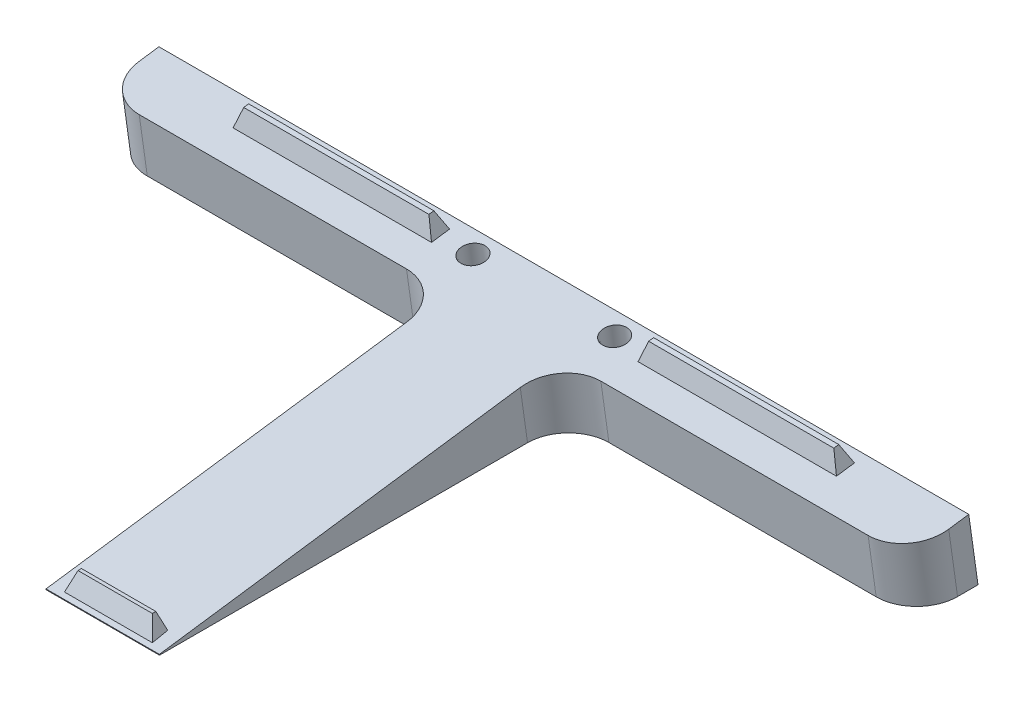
ISO-10303-21;
HEADER;
FILE_DESCRIPTION(('STEP AP214'),'2;1');
FILE_NAME('part.step','',(''),(''),'','','');
FILE_SCHEMA(('AUTOMOTIVE_DESIGN { 1 0 10303 214 1 1 1 1 }'));
ENDSEC;
DATA;
#1=APPLICATION_CONTEXT('core data for automotive mechanical design processes');
#2=APPLICATION_PROTOCOL_DEFINITION('international standard','automotive_design',2000,#1);
#3=PRODUCT_CONTEXT('',#1,'mechanical');
#4=PRODUCT('Part','Part','',(#3));
#5=PRODUCT_RELATED_PRODUCT_CATEGORY('part','',(#4));
#6=PRODUCT_DEFINITION_FORMATION('','',#4);
#7=PRODUCT_DEFINITION_CONTEXT('part definition',#1,'design');
#8=PRODUCT_DEFINITION('design','',#6,#7);
#9=PRODUCT_DEFINITION_SHAPE('','',#8);
#10=(LENGTH_UNIT() NAMED_UNIT(*) SI_UNIT(.MILLI.,.METRE.));
#11=(NAMED_UNIT(*) PLANE_ANGLE_UNIT() SI_UNIT($,.RADIAN.));
#12=(NAMED_UNIT(*) SI_UNIT($,.STERADIAN.) SOLID_ANGLE_UNIT());
#13=UNCERTAINTY_MEASURE_WITH_UNIT(LENGTH_MEASURE(1.E-05),#10,'distance_accuracy_value','');
#14=(GEOMETRIC_REPRESENTATION_CONTEXT(3) GLOBAL_UNCERTAINTY_ASSIGNED_CONTEXT((#13)) GLOBAL_UNIT_ASSIGNED_CONTEXT((#10,
#11,#12)) REPRESENTATION_CONTEXT('',''));
#15=CARTESIAN_POINT('',(0.,0.,0.));
#16=DIRECTION('',(0.,0.,1.));
#17=DIRECTION('',(1.,0.,0.));
#18=AXIS2_PLACEMENT_3D('',#15,#16,#17);
#19=CARTESIAN_POINT('',(0.,-0.173024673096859,-0.024317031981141));
#20=DIRECTION('',(0.,-0.99026806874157,-0.139173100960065));
#21=DIRECTION('',(0.,0.139173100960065,-0.99026806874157));
#22=AXIS2_PLACEMENT_3D('',#19,#20,#21);
#23=PLANE('',#22);
#24=CARTESIAN_POINT('',(17.5,15.5178007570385,-111.670341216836));
#25=DIRECTION('',(0.,0.99026806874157,0.139173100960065));
#26=DIRECTION('',(0.,0.139173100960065,-0.99026806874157));
#27=AXIS2_PLACEMENT_3D('',#24,#25,#26);
#28=CIRCLE('',#27,3.);
#29=CARTESIAN_POINT('',(17.5,15.9353200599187,-114.641145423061));
#30=VERTEX_POINT('',#29);
#31=EDGE_CURVE('E246',#30,#30,#28,.T.);
#32=ORIENTED_EDGE('',*,*,#31,.F.);
#33=EDGE_LOOP('',(#32));
#34=FACE_BOUND('',#33,.T.);
#35=DIRECTION('',(0.,0.139173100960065,-0.99026806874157));
#36=VECTOR('',#35,1.);
#37=CARTESIAN_POINT('',(74.5,15.2046612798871,-109.442238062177));
#38=LINE('',#37,#36);
#39=CARTESIAN_POINT('',(74.5,15.2046612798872,-109.442238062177));
#40=VERTEX_POINT('',#39);
#41=CARTESIAN_POINT('',(74.5,15.8309402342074,-113.898444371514));
#42=VERTEX_POINT('',#41);
#43=EDGE_CURVE('E240',#40,#42,#38,.T.);
#44=ORIENTED_EDGE('',*,*,#43,.F.);
#45=DIRECTION('',(-1.,0.,0.));
#46=VECTOR('',#45,1.);
#47=CARTESIAN_POINT('',(74.5,15.2046612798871,-109.442238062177));
#48=LINE('',#47,#46);
#49=CARTESIAN_POINT('',(25.5,15.2046612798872,-109.442238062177));
#50=VERTEX_POINT('',#49);
#51=EDGE_CURVE('E237',#40,#50,#48,.T.);
#52=ORIENTED_EDGE('',*,*,#51,.T.);
#53=DIRECTION('',(0.,0.139173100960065,-0.99026806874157));
#54=VECTOR('',#53,1.);
#55=CARTESIAN_POINT('',(25.5,15.2046612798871,-109.442238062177));
#56=LINE('',#55,#54);
#57=CARTESIAN_POINT('',(25.5,15.8309402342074,-113.898444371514));
#58=VERTEX_POINT('',#57);
#59=EDGE_CURVE('E234',#50,#58,#56,.T.);
#60=ORIENTED_EDGE('',*,*,#59,.T.);
#61=DIRECTION('',(-1.,0.,0.));
#62=VECTOR('',#61,1.);
#63=CARTESIAN_POINT('',(74.5,15.8309402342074,-113.898444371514));
#64=LINE('',#63,#62);
#65=EDGE_CURVE('E231',#42,#58,#64,.T.);
#66=ORIENTED_EDGE('',*,*,#65,.F.);
#67=EDGE_LOOP('',(#44,#52,#60,#66));
#68=FACE_BOUND('',#67,.T.);
#69=DIRECTION('',(0.,0.139173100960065,-0.99026806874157));
#70=VECTOR('',#69,1.);
#71=CARTESIAN_POINT('',(-100.,14.1260697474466,-101.767660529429));
#72=LINE('',#71,#70);
#73=CARTESIAN_POINT('',(-100.,15.5178007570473,-111.670341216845));
#74=VERTEX_POINT('',#73);
#75=CARTESIAN_POINT('',(-100.,16.2136662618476,-116.621681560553));
#76=VERTEX_POINT('',#75);
#77=EDGE_CURVE('E370',#74,#76,#72,.T.);
#78=ORIENTED_EDGE('',*,*,#77,.F.);
#79=CARTESIAN_POINT('',(-90.,15.5178007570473,-111.670341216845));
#80=DIRECTION('',(0.,-0.99026806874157,-0.139173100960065));
#81=DIRECTION('',(0.,0.139173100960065,-0.99026806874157));
#82=AXIS2_PLACEMENT_3D('',#79,#80,#81);
#83=CIRCLE('',#82,10.);
#84=CARTESIAN_POINT('',(-90.,14.1260697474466,-101.767660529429));
#85=VERTEX_POINT('',#84);
#86=EDGE_CURVE('E383',#74,#85,#83,.F.);
#87=ORIENTED_EDGE('',*,*,#86,.T.);
#88=DIRECTION('',(-1.,0.,0.));
#89=VECTOR('',#88,1.);
#90=CARTESIAN_POINT('',(-14.,14.1260697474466,-101.767660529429));
#91=LINE('',#90,#89);
#92=CARTESIAN_POINT('',(-24.,14.1260697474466,-101.767660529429));
#93=VERTEX_POINT('',#92);
#94=EDGE_CURVE('E367',#93,#85,#91,.T.);
#95=ORIENTED_EDGE('',*,*,#94,.F.);
#96=CARTESIAN_POINT('',(-24.,12.734338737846,-91.8649798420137));
#97=DIRECTION('',(0.,-0.99026806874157,-0.139173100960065));
#98=DIRECTION('',(0.,0.139173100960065,-0.99026806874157));
#99=AXIS2_PLACEMENT_3D('',#96,#97,#98);
#100=CIRCLE('',#99,10.);
#101=CARTESIAN_POINT('',(-14.,12.734338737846,-91.8649798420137));
#102=VERTEX_POINT('',#101);
#103=EDGE_CURVE('E43',#93,#102,#100,.T.);
#104=ORIENTED_EDGE('',*,*,#103,.T.);
#105=DIRECTION('',(0.,0.139173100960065,-0.99026806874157));
#106=VECTOR('',#105,1.);
#107=CARTESIAN_POINT('',(-14.,14.1260697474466,-101.767660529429));
#108=LINE('',#107,#106);
#109=CARTESIAN_POINT('',(-14.,0.208759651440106,-2.74085365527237));
#110=VERTEX_POINT('',#109);
#111=EDGE_CURVE('E364',#110,#102,#108,.T.);
#112=ORIENTED_EDGE('',*,*,#111,.F.);
#113=DIRECTION('',(-1.,0.,0.));
#114=VECTOR('',#113,1.);
#115=CARTESIAN_POINT('',(0.,0.208759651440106,-2.74085365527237));
#116=LINE('',#115,#114);
#117=CARTESIAN_POINT('',(14.,0.208759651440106,-2.74085365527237));
#118=VERTEX_POINT('',#117);
#119=EDGE_CURVE('E349',#118,#110,#116,.T.);
#120=ORIENTED_EDGE('',*,*,#119,.F.);
#121=DIRECTION('',(0.,0.139173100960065,-0.99026806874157));
#122=VECTOR('',#121,1.);
#123=CARTESIAN_POINT('',(14.,14.1260697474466,-101.767660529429));
#124=LINE('',#123,#122);
#125=CARTESIAN_POINT('',(14.,12.734338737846,-91.8649798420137));
#126=VERTEX_POINT('',#125);
#127=EDGE_CURVE('E267',#118,#126,#124,.T.);
#128=ORIENTED_EDGE('',*,*,#127,.T.);
#129=CARTESIAN_POINT('',(24.,12.734338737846,-91.8649798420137));
#130=DIRECTION('',(0.,0.99026806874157,0.139173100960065));
#131=DIRECTION('',(0.,0.139173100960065,-0.99026806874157));
#132=AXIS2_PLACEMENT_3D('',#129,#130,#131);
#133=CIRCLE('',#132,10.);
#134=CARTESIAN_POINT('',(24.,14.1260697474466,-101.767660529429));
#135=VERTEX_POINT('',#134);
#136=EDGE_CURVE('E306',#135,#126,#133,.T.);
#137=ORIENTED_EDGE('',*,*,#136,.F.);
#138=DIRECTION('',(1.,0.,0.));
#139=VECTOR('',#138,1.);
#140=CARTESIAN_POINT('',(14.,14.1260697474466,-101.767660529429));
#141=LINE('',#140,#139);
#142=CARTESIAN_POINT('',(90.,14.1260697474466,-101.767660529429));
#143=VERTEX_POINT('',#142);
#144=EDGE_CURVE('E281',#135,#143,#141,.T.);
#145=ORIENTED_EDGE('',*,*,#144,.T.);
#146=CARTESIAN_POINT('',(90.,15.5178007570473,-111.670341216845));
#147=DIRECTION('',(0.,0.99026806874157,0.139173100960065));
#148=DIRECTION('',(0.,0.139173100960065,-0.99026806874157));
#149=AXIS2_PLACEMENT_3D('',#146,#147,#148);
#150=CIRCLE('',#149,10.);
#151=CARTESIAN_POINT('',(100.,15.5178007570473,-111.670341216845));
#152=VERTEX_POINT('',#151);
#153=EDGE_CURVE('E293',#152,#143,#150,.F.);
#154=ORIENTED_EDGE('',*,*,#153,.F.);
#155=DIRECTION('',(0.,0.139173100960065,-0.99026806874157));
#156=VECTOR('',#155,1.);
#157=CARTESIAN_POINT('',(100.,14.1260697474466,-101.767660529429));
#158=LINE('',#157,#156);
#159=CARTESIAN_POINT('',(100.,16.2136662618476,-116.621681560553));
#160=VERTEX_POINT('',#159);
#161=EDGE_CURVE('E284',#152,#160,#158,.T.);
#162=ORIENTED_EDGE('',*,*,#161,.T.);
#163=DIRECTION('',(1.,0.,0.));
#164=VECTOR('',#163,1.);
#165=CARTESIAN_POINT('',(0.,16.2136662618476,-116.621681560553));
#166=LINE('',#165,#164);
#167=EDGE_CURVE('E372',#76,#160,#166,.T.);
#168=ORIENTED_EDGE('',*,*,#167,.F.);
#169=EDGE_LOOP('',(#78,#87,#95,#104,#112,#120,#128,#137,#145,#154,#162,#168));
#170=FACE_BOUND('',#169,.T.);
#171=CARTESIAN_POINT('',(-17.5,15.5178007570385,-111.670341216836));
#172=DIRECTION('',(0.,-0.99026806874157,-0.139173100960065));
#173=DIRECTION('',(0.,0.139173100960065,-0.99026806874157));
#174=AXIS2_PLACEMENT_3D('',#171,#172,#173);
#175=CIRCLE('',#174,3.);
#176=CARTESIAN_POINT('',(-17.5,15.9353200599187,-114.641145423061));
#177=VERTEX_POINT('',#176);
#178=EDGE_CURVE('E325',#177,#177,#175,.T.);
#179=ORIENTED_EDGE('',*,*,#178,.T.);
#180=EDGE_LOOP('',(#179));
#181=FACE_BOUND('',#180,.T.);
#182=DIRECTION('',(0.,0.139173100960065,-0.99026806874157));
#183=VECTOR('',#182,1.);
#184=CARTESIAN_POINT('',(-74.5,15.2046612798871,-109.442238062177));
#185=LINE('',#184,#183);
#186=CARTESIAN_POINT('',(-74.5,15.2046612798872,-109.442238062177));
#187=VERTEX_POINT('',#186);
#188=CARTESIAN_POINT('',(-74.5,15.8309402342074,-113.898444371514));
#189=VERTEX_POINT('',#188);
#190=EDGE_CURVE('E319',#187,#189,#185,.T.);
#191=ORIENTED_EDGE('',*,*,#190,.T.);
#192=DIRECTION('',(1.,0.,0.));
#193=VECTOR('',#192,1.);
#194=CARTESIAN_POINT('',(-74.5,15.8309402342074,-113.898444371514));
#195=LINE('',#194,#193);
#196=CARTESIAN_POINT('',(-25.5,15.8309402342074,-113.898444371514));
#197=VERTEX_POINT('',#196);
#198=EDGE_CURVE('E311',#189,#197,#195,.T.);
#199=ORIENTED_EDGE('',*,*,#198,.T.);
#200=DIRECTION('',(0.,0.139173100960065,-0.99026806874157));
#201=VECTOR('',#200,1.);
#202=CARTESIAN_POINT('',(-25.5,15.2046612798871,-109.442238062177));
#203=LINE('',#202,#201);
#204=CARTESIAN_POINT('',(-25.5,15.2046612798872,-109.442238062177));
#205=VERTEX_POINT('',#204);
#206=EDGE_CURVE('E313',#205,#197,#203,.T.);
#207=ORIENTED_EDGE('',*,*,#206,.F.);
#208=DIRECTION('',(1.,0.,0.));
#209=VECTOR('',#208,1.);
#210=CARTESIAN_POINT('',(-74.5,15.2046612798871,-109.442238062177));
#211=LINE('',#210,#209);
#212=EDGE_CURVE('E316',#187,#205,#211,.T.);
#213=ORIENTED_EDGE('',*,*,#212,.F.);
#214=EDGE_LOOP('',(#191,#199,#207,#213));
#215=FACE_BOUND('',#214,.T.);
#216=DIRECTION('',(0.0505900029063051,0.138994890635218,-0.989000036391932));
#217=VECTOR('',#216,1.);
#218=CARTESIAN_POINT('',(-11.0346618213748,-0.0952325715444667,-0.577836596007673));
#219=LINE('',#218,#217);
#220=CARTESIAN_POINT('',(-10.6471902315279,0.96933687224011,-8.15264178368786));
#221=VERTEX_POINT('',#220);
#222=CARTESIAN_POINT('',(-10.8517465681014,0.407322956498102,-4.15370498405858));
#223=VERTEX_POINT('',#222);
#224=EDGE_CURVE('E214',#221,#223,#219,.F.);
#225=ORIENTED_EDGE('',*,*,#224,.F.);
#226=DIRECTION('',(1.,0.,0.));
#227=VECTOR('',#226,1.);
#228=CARTESIAN_POINT('',(0.,0.969336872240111,-8.15264178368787));
#229=LINE('',#228,#227);
#230=CARTESIAN_POINT('',(10.6471902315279,0.969336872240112,-8.15264178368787));
#231=VERTEX_POINT('',#230);
#232=EDGE_CURVE('E215',#231,#221,#229,.F.);
#233=ORIENTED_EDGE('',*,*,#232,.F.);
#234=DIRECTION('',(0.0505900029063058,-0.138994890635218,0.989000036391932));
#235=VECTOR('',#234,1.);
#236=CARTESIAN_POINT('',(11.0346618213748,-0.0952325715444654,-0.577836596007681));
#237=LINE('',#236,#235);
#238=CARTESIAN_POINT('',(10.8517465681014,0.407322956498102,-4.15370498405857));
#239=VERTEX_POINT('',#238);
#240=EDGE_CURVE('E55',#239,#231,#237,.F.);
#241=ORIENTED_EDGE('',*,*,#240,.F.);
#242=DIRECTION('',(-1.,0.,0.));
#243=VECTOR('',#242,1.);
#244=CARTESIAN_POINT('',(0.,0.407322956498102,-4.15370498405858));
#245=LINE('',#244,#243);
#246=EDGE_CURVE('E50',#223,#239,#245,.F.);
#247=ORIENTED_EDGE('',*,*,#246,.F.);
#248=EDGE_LOOP('',(#225,#233,#241,#247));
#249=FACE_BOUND('',#248,.T.);
#250=ADVANCED_FACE('F35',(#34,#68,#170,#181,#215,#249),#23,.F.);
#251=CARTESIAN_POINT('',(0.,-143.65349220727,-139.089545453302));
#252=DIRECTION('',(0.,-0.139173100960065,0.99026806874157));
#253=DIRECTION('',(0.,-0.99026806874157,-0.139173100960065));
#254=AXIS2_PLACEMENT_3D('',#251,#252,#253);
#255=PLANE('',#254);
#256=ORIENTED_EDGE('',*,*,#167,.T.);
#257=DIRECTION('',(0.,0.99026806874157,0.139173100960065));
#258=VECTOR('',#257,1.);
#259=CARTESIAN_POINT('',(100.,-143.65349220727,-139.089545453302));
#260=LINE('',#259,#258);
#261=CARTESIAN_POINT('',(100.,0.,-118.900363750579));
#262=VERTEX_POINT('',#261);
#263=EDGE_CURVE('E287',#262,#160,#260,.T.);
#264=ORIENTED_EDGE('',*,*,#263,.F.);
#265=DIRECTION('',(-1.,0.,0.));
#266=VECTOR('',#265,1.);
#267=CARTESIAN_POINT('',(0.,0.,-118.900363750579));
#268=LINE('',#267,#266);
#269=CARTESIAN_POINT('',(-100.,0.,-118.900363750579));
#270=VERTEX_POINT('',#269);
#271=EDGE_CURVE('E354',#262,#270,#268,.T.);
#272=ORIENTED_EDGE('',*,*,#271,.T.);
#273=DIRECTION('',(0.,0.99026806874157,0.139173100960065));
#274=VECTOR('',#273,1.);
#275=CARTESIAN_POINT('',(-100.,-143.65349220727,-139.089545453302));
#276=LINE('',#275,#274);
#277=EDGE_CURVE('E374',#270,#76,#276,.T.);
#278=ORIENTED_EDGE('',*,*,#277,.T.);
#279=EDGE_LOOP('',(#256,#264,#272,#278));
#280=FACE_BOUND('',#279,.T.);
#281=ADVANCED_FACE('F424',(#280),#255,.F.);
#282=CARTESIAN_POINT('',(-100.,-145.741088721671,-124.235524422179));
#283=DIRECTION('',(1.,0.,0.));
#284=DIRECTION('',(0.,0.,-1.));
#285=AXIS2_PLACEMENT_3D('',#282,#283,#284);
#286=PLANE('',#285);
#287=DIRECTION('',(0.,0.,1.));
#288=VECTOR('',#287,1.);
#289=CARTESIAN_POINT('',(-100.,0.,-124.235524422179));
#290=LINE('',#289,#288);
#291=CARTESIAN_POINT('',(-100.,0.,-113.851225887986));
#292=VERTEX_POINT('',#291);
#293=EDGE_CURVE('E350',#270,#292,#290,.T.);
#294=ORIENTED_EDGE('',*,*,#293,.T.);
#295=DIRECTION('',(0.,0.99026806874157,0.139173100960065));
#296=VECTOR('',#295,1.);
#297=CARTESIAN_POINT('',(-100.,-144.34935771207,-134.138205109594));
#298=LINE('',#297,#296);
#299=EDGE_CURVE('E361',#292,#74,#298,.T.);
#300=ORIENTED_EDGE('',*,*,#299,.T.);
#301=ORIENTED_EDGE('',*,*,#77,.T.);
#302=ORIENTED_EDGE('',*,*,#277,.F.);
#303=EDGE_LOOP('',(#294,#300,#301,#302));
#304=FACE_BOUND('',#303,.T.);
#305=ADVANCED_FACE('F420',(#304),#286,.F.);
#306=CARTESIAN_POINT('',(-14.,-145.741088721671,-124.235524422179));
#307=DIRECTION('',(0.,0.139173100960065,-0.99026806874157));
#308=DIRECTION('',(0.,0.99026806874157,0.139173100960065));
#309=AXIS2_PLACEMENT_3D('',#306,#307,#308);
#310=PLANE('',#309);
#311=ORIENTED_EDGE('',*,*,#94,.T.);
#312=DIRECTION('',(0.,0.99026806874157,0.139173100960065));
#313=VECTOR('',#312,1.);
#314=CARTESIAN_POINT('',(-90.,-145.741088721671,-124.235524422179));
#315=LINE('',#314,#313);
#316=CARTESIAN_POINT('',(-90.,0.,-103.7529501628));
#317=VERTEX_POINT('',#316);
#318=EDGE_CURVE('E388',#85,#317,#315,.F.);
#319=ORIENTED_EDGE('',*,*,#318,.T.);
#320=DIRECTION('',(1.,0.,0.));
#321=VECTOR('',#320,1.);
#322=CARTESIAN_POINT('',(-14.,0.,-103.7529501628));
#323=LINE('',#322,#321);
#324=CARTESIAN_POINT('',(-24.,0.,-103.7529501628));
#325=VERTEX_POINT('',#324);
#326=EDGE_CURVE('E353',#317,#325,#323,.T.);
#327=ORIENTED_EDGE('',*,*,#326,.T.);
#328=DIRECTION('',(0.,0.99026806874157,0.139173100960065));
#329=VECTOR('',#328,1.);
#330=CARTESIAN_POINT('',(-24.,14.1260697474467,-101.767660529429));
#331=LINE('',#330,#329);
#332=EDGE_CURVE('E385',#325,#93,#331,.T.);
#333=ORIENTED_EDGE('',*,*,#332,.T.);
#334=EDGE_LOOP('',(#311,#319,#327,#333));
#335=FACE_BOUND('',#334,.T.);
#336=ADVANCED_FACE('F413',(#335),#310,.F.);
#337=CARTESIAN_POINT('',(-14.,-145.741088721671,-124.235524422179));
#338=DIRECTION('',(1.,0.,0.));
#339=DIRECTION('',(0.,0.,-1.));
#340=AXIS2_PLACEMENT_3D('',#337,#338,#339);
#341=PLANE('',#340);
#342=ORIENTED_EDGE('',*,*,#111,.T.);
#343=DIRECTION('',(0.,0.99026806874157,0.139173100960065));
#344=VECTOR('',#343,1.);
#345=CARTESIAN_POINT('',(-14.,-1.39173100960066,-93.8502694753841));
#346=LINE('',#345,#344);
#347=CARTESIAN_POINT('',(-14.,0.,-93.6546744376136));
#348=VERTEX_POINT('',#347);
#349=EDGE_CURVE('E392',#102,#348,#346,.F.);
#350=ORIENTED_EDGE('',*,*,#349,.T.);
#351=DIRECTION('',(0.,0.,1.));
#352=VECTOR('',#351,1.);
#353=CARTESIAN_POINT('',(-14.,0.,-124.235524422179));
#354=LINE('',#353,#352);
#355=CARTESIAN_POINT('',(-14.,0.,-2.77019291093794));
#356=VERTEX_POINT('',#355);
#357=EDGE_CURVE('E357',#348,#356,#354,.T.);
#358=ORIENTED_EDGE('',*,*,#357,.T.);
#359=DIRECTION('',(0.,0.99026806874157,0.139173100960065));
#360=VECTOR('',#359,1.);
#361=CARTESIAN_POINT('',(-14.,-159.658398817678,-25.2087175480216));
#362=LINE('',#361,#360);
#363=EDGE_CURVE('E377',#356,#110,#362,.T.);
#364=ORIENTED_EDGE('',*,*,#363,.T.);
#365=EDGE_LOOP('',(#342,#350,#358,#364));
#366=FACE_BOUND('',#365,.T.);
#367=ADVANCED_FACE('F402',(#366),#341,.F.);
#368=CARTESIAN_POINT('',(0.,-159.658398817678,-25.2087175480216));
#369=DIRECTION('',(0.,0.139173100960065,-0.99026806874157));
#370=DIRECTION('',(0.,0.99026806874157,0.139173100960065));
#371=AXIS2_PLACEMENT_3D('',#368,#369,#370);
#372=PLANE('',#371);
#373=ORIENTED_EDGE('',*,*,#363,.F.);
#374=DIRECTION('',(1.,0.,0.));
#375=VECTOR('',#374,1.);
#376=CARTESIAN_POINT('',(0.,0.,-2.77019291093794));
#377=LINE('',#376,#375);
#378=CARTESIAN_POINT('',(14.,0.,-2.77019291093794));
#379=VERTEX_POINT('',#378);
#380=EDGE_CURVE('E359',#356,#379,#377,.T.);
#381=ORIENTED_EDGE('',*,*,#380,.T.);
#382=DIRECTION('',(0.,0.99026806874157,0.139173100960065));
#383=VECTOR('',#382,1.);
#384=CARTESIAN_POINT('',(14.,-159.658398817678,-25.2087175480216));
#385=LINE('',#384,#383);
#386=EDGE_CURVE('E272',#379,#118,#385,.T.);
#387=ORIENTED_EDGE('',*,*,#386,.T.);
#388=ORIENTED_EDGE('',*,*,#119,.T.);
#389=EDGE_LOOP('',(#373,#381,#387,#388));
#390=FACE_BOUND('',#389,.T.);
#391=ADVANCED_FACE('F447',(#390),#372,.F.);
#392=CARTESIAN_POINT('',(0.,0.,0.));
#393=DIRECTION('',(0.,1.,0.));
#394=DIRECTION('',(0.,0.,1.));
#395=AXIS2_PLACEMENT_3D('',#392,#393,#394);
#396=PLANE('',#395);
#397=CARTESIAN_POINT('',(17.5,0.,-113.868806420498));
#398=DIRECTION('',(0.,-1.,0.));
#399=DIRECTION('',(0.,0.,-1.));
#400=AXIS2_PLACEMENT_3D('',#397,#398,#399);
#401=ELLIPSE('',#400,3.58216587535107,3.54726176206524);
#402=CARTESIAN_POINT('',(17.5,0.,-117.450972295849));
#403=VERTEX_POINT('',#402);
#404=EDGE_CURVE('E264',#403,#403,#401,.T.);
#405=ORIENTED_EDGE('',*,*,#404,.F.);
#406=EDGE_LOOP('',(#405));
#407=FACE_BOUND('',#406,.T.);
#408=ORIENTED_EDGE('',*,*,#326,.F.);
#409=CARTESIAN_POINT('',(-90.,0.,-113.851225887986));
#410=DIRECTION('',(0.,1.,0.));
#411=DIRECTION('',(0.,0.,1.));
#412=AXIS2_PLACEMENT_3D('',#409,#410,#411);
#413=ELLIPSE('',#412,10.0982757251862,10.);
#414=EDGE_CURVE('E390',#317,#292,#413,.F.);
#415=ORIENTED_EDGE('',*,*,#414,.T.);
#416=ORIENTED_EDGE('',*,*,#293,.F.);
#417=ORIENTED_EDGE('',*,*,#271,.F.);
#418=DIRECTION('',(0.,0.,1.));
#419=VECTOR('',#418,1.);
#420=CARTESIAN_POINT('',(100.,0.,-124.235524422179));
#421=LINE('',#420,#419);
#422=CARTESIAN_POINT('',(100.,0.,-113.851225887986));
#423=VERTEX_POINT('',#422);
#424=EDGE_CURVE('E268',#262,#423,#421,.T.);
#425=ORIENTED_EDGE('',*,*,#424,.T.);
#426=CARTESIAN_POINT('',(90.,0.,-113.851225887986));
#427=DIRECTION('',(0.,-1.,0.));
#428=DIRECTION('',(0.,0.,1.));
#429=AXIS2_PLACEMENT_3D('',#426,#427,#428);
#430=ELLIPSE('',#429,10.0982757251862,10.);
#431=CARTESIAN_POINT('',(90.,0.,-103.7529501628));
#432=VERTEX_POINT('',#431);
#433=EDGE_CURVE('E301',#432,#423,#430,.F.);
#434=ORIENTED_EDGE('',*,*,#433,.F.);
#435=DIRECTION('',(-1.,0.,0.));
#436=VECTOR('',#435,1.);
#437=CARTESIAN_POINT('',(14.,0.,-103.7529501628));
#438=LINE('',#437,#436);
#439=CARTESIAN_POINT('',(24.,0.,-103.7529501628));
#440=VERTEX_POINT('',#439);
#441=EDGE_CURVE('E271',#432,#440,#438,.T.);
#442=ORIENTED_EDGE('',*,*,#441,.T.);
#443=CARTESIAN_POINT('',(24.,0.,-93.6546744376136));
#444=DIRECTION('',(0.,-1.,0.));
#445=DIRECTION('',(0.,0.,-1.));
#446=AXIS2_PLACEMENT_3D('',#443,#444,#445);
#447=ELLIPSE('',#446,10.0982757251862,10.);
#448=CARTESIAN_POINT('',(14.,0.,-93.6546744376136));
#449=VERTEX_POINT('',#448);
#450=EDGE_CURVE('E309',#449,#440,#447,.T.);
#451=ORIENTED_EDGE('',*,*,#450,.F.);
#452=DIRECTION('',(0.,0.,1.));
#453=VECTOR('',#452,1.);
#454=CARTESIAN_POINT('',(14.,0.,-124.235524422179));
#455=LINE('',#454,#453);
#456=EDGE_CURVE('E275',#449,#379,#455,.T.);
#457=ORIENTED_EDGE('',*,*,#456,.T.);
#458=ORIENTED_EDGE('',*,*,#380,.F.);
#459=ORIENTED_EDGE('',*,*,#357,.F.);
#460=CARTESIAN_POINT('',(-24.,0.,-93.6546744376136));
#461=DIRECTION('',(0.,1.,0.));
#462=DIRECTION('',(0.,0.,-1.));
#463=AXIS2_PLACEMENT_3D('',#460,#461,#462);
#464=ELLIPSE('',#463,10.0982757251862,10.);
#465=EDGE_CURVE('E12',#348,#325,#464,.T.);
#466=ORIENTED_EDGE('',*,*,#465,.T.);
#467=EDGE_LOOP('',(#408,#415,#416,#417,#425,#434,#442,#451,#457,#458,#459,#466));
#468=FACE_BOUND('',#467,.T.);
#469=CARTESIAN_POINT('',(-17.5,0.,-113.868806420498));
#470=DIRECTION('',(0.,1.,0.));
#471=DIRECTION('',(0.,0.,-1.));
#472=AXIS2_PLACEMENT_3D('',#469,#470,#471);
#473=ELLIPSE('',#472,3.58216587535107,3.54726176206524);
#474=CARTESIAN_POINT('',(-17.5,0.,-117.450972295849));
#475=VERTEX_POINT('',#474);
#476=EDGE_CURVE('E346',#475,#475,#473,.T.);
#477=ORIENTED_EDGE('',*,*,#476,.T.);
#478=EDGE_LOOP('',(#477));
#479=FACE_BOUND('',#478,.T.);
#480=ADVANCED_FACE('F408',(#407,#468,#479),#396,.F.);
#481=CARTESIAN_POINT('',(-17.5,15.5178007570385,-111.670341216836));
#482=DIRECTION('',(0.,-0.99026806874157,-0.139173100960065));
#483=DIRECTION('',(0.,0.139173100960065,-0.99026806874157));
#484=AXIS2_PLACEMENT_3D('',#481,#482,#483);
#485=CONICAL_SURFACE('',#484,3.,0.0349065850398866);
#486=ORIENTED_EDGE('',*,*,#476,.F.);
#487=EDGE_LOOP('',(#486));
#488=FACE_BOUND('',#487,.T.);
#489=ORIENTED_EDGE('',*,*,#178,.F.);
#490=EDGE_LOOP('',(#489));
#491=FACE_BOUND('',#490,.T.);
#492=ADVANCED_FACE('F454',(#488,#491),#485,.F.);
#493=CARTESIAN_POINT('',(-90.,-144.34935771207,-134.138205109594));
#494=DIRECTION('',(0.,0.99026806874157,0.139173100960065));
#495=DIRECTION('',(0.,-0.139173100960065,0.99026806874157));
#496=AXIS2_PLACEMENT_3D('',#493,#494,#495);
#497=CYLINDRICAL_SURFACE('',#496,10.);
#498=ORIENTED_EDGE('',*,*,#414,.F.);
#499=ORIENTED_EDGE('',*,*,#318,.F.);
#500=ORIENTED_EDGE('',*,*,#86,.F.);
#501=ORIENTED_EDGE('',*,*,#299,.F.);
#502=EDGE_LOOP('',(#498,#499,#500,#501));
#503=FACE_BOUND('',#502,.T.);
#504=ADVANCED_FACE('F416',(#503),#497,.T.);
#505=CARTESIAN_POINT('',(-24.,-147.132819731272,-114.332843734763));
#506=DIRECTION('',(0.,-0.99026806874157,-0.139173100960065));
#507=DIRECTION('',(0.,0.139173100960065,-0.99026806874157));
#508=AXIS2_PLACEMENT_3D('',#505,#506,#507);
#509=CYLINDRICAL_SURFACE('',#508,10.);
#510=ORIENTED_EDGE('',*,*,#465,.F.);
#511=ORIENTED_EDGE('',*,*,#349,.F.);
#512=ORIENTED_EDGE('',*,*,#103,.F.);
#513=ORIENTED_EDGE('',*,*,#332,.F.);
#514=EDGE_LOOP('',(#510,#511,#512,#513));
#515=FACE_BOUND('',#514,.T.);
#516=ADVANCED_FACE('F37',(#515),#509,.F.);
#517=CARTESIAN_POINT('',(-74.5,15.8309402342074,-113.898444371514));
#518=DIRECTION('',(0.,0.469471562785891,-0.882947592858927));
#519=DIRECTION('',(0.,0.882947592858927,0.469471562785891));
#520=AXIS2_PLACEMENT_3D('',#517,#518,#519);
#521=PLANE('',#520);
#522=ORIENTED_EDGE('',*,*,#198,.F.);
#523=DIRECTION('',(-0.323615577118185,-0.835434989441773,-0.444208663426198));
#524=VECTOR('',#523,1.);
#525=CARTESIAN_POINT('',(-74.0287283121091,17.0475592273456,-113.251556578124));
#526=LINE('',#525,#524);
#527=CARTESIAN_POINT('',(-72.8621339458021,20.0591996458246,-111.650238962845));
#528=VERTEX_POINT('',#527);
#529=EDGE_CURVE('E322',#528,#189,#526,.T.);
#530=ORIENTED_EDGE('',*,*,#529,.F.);
#531=DIRECTION('',(1.,0.,0.));
#532=VECTOR('',#531,1.);
#533=CARTESIAN_POINT('',(-74.5,20.0591996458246,-111.650238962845));
#534=LINE('',#533,#532);
#535=CARTESIAN_POINT('',(-27.1378660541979,20.0591996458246,-111.650238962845));
#536=VERTEX_POINT('',#535);
#537=EDGE_CURVE('E321',#528,#536,#534,.T.);
#538=ORIENTED_EDGE('',*,*,#537,.T.);
#539=DIRECTION('',(-0.323615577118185,0.835434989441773,0.444208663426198));
#540=VECTOR('',#539,1.);
#541=CARTESIAN_POINT('',(-25.9712716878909,17.0475592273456,-113.251556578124));
#542=LINE('',#541,#540);
#543=EDGE_CURVE('E327',#536,#197,#542,.F.);
#544=ORIENTED_EDGE('',*,*,#543,.T.);
#545=EDGE_LOOP('',(#522,#530,#538,#544));
#546=FACE_BOUND('',#545,.T.);
#547=ADVANCED_FACE('F514',(#546),#521,.T.);
#548=CARTESIAN_POINT('',(-74.5,15.2046612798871,-109.442238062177));
#549=DIRECTION('',(-0.939692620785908,0.338691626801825,0.0476000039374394));
#550=DIRECTION('',(-0.33907597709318,-0.940758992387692,0.));
#551=AXIS2_PLACEMENT_3D('',#548,#549,#550);
#552=PLANE('',#551);
#553=ORIENTED_EDGE('',*,*,#190,.F.);
#554=DIRECTION('',(0.323615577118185,0.92551215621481,-0.196723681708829));
#555=VECTOR('',#554,1.);
#556=CARTESIAN_POINT('',(-74.5,15.2046612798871,-109.442238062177));
#557=LINE('',#556,#555);
#558=CARTESIAN_POINT('',(-72.8621339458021,19.8888144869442,-110.437885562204));
#559=VERTEX_POINT('',#558);
#560=EDGE_CURVE('E326',#559,#187,#557,.F.);
#561=ORIENTED_EDGE('',*,*,#560,.F.);
#562=DIRECTION('',(0.,0.139173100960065,-0.99026806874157));
#563=VECTOR('',#562,1.);
#564=CARTESIAN_POINT('',(-72.8621339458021,19.6608675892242,-108.815959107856));
#565=LINE('',#564,#563);
#566=EDGE_CURVE('E331',#559,#528,#565,.T.);
#567=ORIENTED_EDGE('',*,*,#566,.T.);
#568=ORIENTED_EDGE('',*,*,#529,.T.);
#569=EDGE_LOOP('',(#553,#561,#567,#568));
#570=FACE_BOUND('',#569,.T.);
#571=ADVANCED_FACE('F521',(#570),#552,.T.);
#572=CARTESIAN_POINT('',(-74.5,15.2046612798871,-109.442238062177));
#573=DIRECTION('',(0.,0.20791169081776,0.978147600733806));
#574=DIRECTION('',(0.,-0.978147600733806,0.20791169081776));
#575=AXIS2_PLACEMENT_3D('',#572,#573,#574);
#576=PLANE('',#575);
#577=ORIENTED_EDGE('',*,*,#212,.T.);
#578=DIRECTION('',(0.323615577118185,-0.92551215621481,0.196723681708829));
#579=VECTOR('',#578,1.);
#580=CARTESIAN_POINT('',(-25.5,15.2046612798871,-109.442238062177));
#581=LINE('',#580,#579);
#582=CARTESIAN_POINT('',(-27.1378660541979,19.8888144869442,-110.437885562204));
#583=VERTEX_POINT('',#582);
#584=EDGE_CURVE('E330',#583,#205,#581,.T.);
#585=ORIENTED_EDGE('',*,*,#584,.F.);
#586=DIRECTION('',(-1.,0.,0.));
#587=VECTOR('',#586,1.);
#588=CARTESIAN_POINT('',(-74.5,19.8888144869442,-110.437885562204));
#589=LINE('',#588,#587);
#590=EDGE_CURVE('E341',#559,#583,#589,.F.);
#591=ORIENTED_EDGE('',*,*,#590,.F.);
#592=ORIENTED_EDGE('',*,*,#560,.T.);
#593=EDGE_LOOP('',(#577,#585,#591,#592));
#594=FACE_BOUND('',#593,.T.);
#595=ADVANCED_FACE('F530',(#594),#576,.T.);
#596=CARTESIAN_POINT('',(-25.5,15.2046612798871,-109.442238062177));
#597=DIRECTION('',(0.939692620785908,0.338691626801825,0.0476000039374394));
#598=DIRECTION('',(-0.33907597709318,0.940758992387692,0.));
#599=AXIS2_PLACEMENT_3D('',#596,#597,#598);
#600=PLANE('',#599);
#601=ORIENTED_EDGE('',*,*,#206,.T.);
#602=ORIENTED_EDGE('',*,*,#543,.F.);
#603=DIRECTION('',(0.,-0.139173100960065,0.99026806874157));
#604=VECTOR('',#603,1.);
#605=CARTESIAN_POINT('',(-27.1378660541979,19.6608675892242,-108.815959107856));
#606=LINE('',#605,#604);
#607=EDGE_CURVE('E338',#583,#536,#606,.F.);
#608=ORIENTED_EDGE('',*,*,#607,.F.);
#609=ORIENTED_EDGE('',*,*,#584,.T.);
#610=EDGE_LOOP('',(#601,#602,#608,#609));
#611=FACE_BOUND('',#610,.T.);
#612=ADVANCED_FACE('F539',(#611),#600,.T.);
#613=CARTESIAN_POINT('',(0.,4.28318163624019,0.60196192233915));
#614=DIRECTION('',(0.,0.99026806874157,0.139173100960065));
#615=DIRECTION('',(0.,-0.139173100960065,0.99026806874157));
#616=AXIS2_PLACEMENT_3D('',#613,#614,#615);
#617=PLANE('',#616);
#618=ORIENTED_EDGE('',*,*,#537,.F.);
#619=ORIENTED_EDGE('',*,*,#566,.F.);
#620=ORIENTED_EDGE('',*,*,#590,.T.);
#621=ORIENTED_EDGE('',*,*,#607,.T.);
#622=EDGE_LOOP('',(#618,#619,#620,#621));
#623=FACE_BOUND('',#622,.T.);
#624=ADVANCED_FACE('F548',(#623),#617,.T.);
#625=CARTESIAN_POINT('',(100.,-145.741088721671,-124.235524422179));
#626=DIRECTION('',(-1.,0.,0.));
#627=DIRECTION('',(0.,0.,-1.));
#628=AXIS2_PLACEMENT_3D('',#625,#626,#627);
#629=PLANE('',#628);
#630=ORIENTED_EDGE('',*,*,#424,.F.);
#631=ORIENTED_EDGE('',*,*,#263,.T.);
#632=ORIENTED_EDGE('',*,*,#161,.F.);
#633=DIRECTION('',(0.,0.99026806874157,0.139173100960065));
#634=VECTOR('',#633,1.);
#635=CARTESIAN_POINT('',(100.,-144.34935771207,-134.138205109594));
#636=LINE('',#635,#634);
#637=EDGE_CURVE('E278',#423,#152,#636,.T.);
#638=ORIENTED_EDGE('',*,*,#637,.F.);
#639=EDGE_LOOP('',(#630,#631,#632,#638));
#640=FACE_BOUND('',#639,.T.);
#641=ADVANCED_FACE('F428',(#640),#629,.F.);
#642=CARTESIAN_POINT('',(14.,-145.741088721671,-124.235524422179));
#643=DIRECTION('',(0.,0.139173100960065,-0.99026806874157));
#644=DIRECTION('',(0.,0.99026806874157,0.139173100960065));
#645=AXIS2_PLACEMENT_3D('',#642,#643,#644);
#646=PLANE('',#645);
#647=ORIENTED_EDGE('',*,*,#144,.F.);
#648=DIRECTION('',(0.,0.99026806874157,0.139173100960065));
#649=VECTOR('',#648,1.);
#650=CARTESIAN_POINT('',(24.,14.1260697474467,-101.767660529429));
#651=LINE('',#650,#649);
#652=EDGE_CURVE('E296',#440,#135,#651,.T.);
#653=ORIENTED_EDGE('',*,*,#652,.F.);
#654=ORIENTED_EDGE('',*,*,#441,.F.);
#655=DIRECTION('',(0.,0.99026806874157,0.139173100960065));
#656=VECTOR('',#655,1.);
#657=CARTESIAN_POINT('',(90.,-145.741088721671,-124.235524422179));
#658=LINE('',#657,#656);
#659=EDGE_CURVE('E298',#143,#432,#658,.F.);
#660=ORIENTED_EDGE('',*,*,#659,.F.);
#661=EDGE_LOOP('',(#647,#653,#654,#660));
#662=FACE_BOUND('',#661,.T.);
#663=ADVANCED_FACE('F437',(#662),#646,.F.);
#664=CARTESIAN_POINT('',(14.,-145.741088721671,-124.235524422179));
#665=DIRECTION('',(-1.,0.,0.));
#666=DIRECTION('',(0.,0.,-1.));
#667=AXIS2_PLACEMENT_3D('',#664,#665,#666);
#668=PLANE('',#667);
#669=ORIENTED_EDGE('',*,*,#127,.F.);
#670=ORIENTED_EDGE('',*,*,#386,.F.);
#671=ORIENTED_EDGE('',*,*,#456,.F.);
#672=DIRECTION('',(0.,0.99026806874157,0.139173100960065));
#673=VECTOR('',#672,1.);
#674=CARTESIAN_POINT('',(14.,-1.39173100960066,-93.8502694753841));
#675=LINE('',#674,#673);
#676=EDGE_CURVE('E303',#126,#449,#675,.F.);
#677=ORIENTED_EDGE('',*,*,#676,.F.);
#678=EDGE_LOOP('',(#669,#670,#671,#677));
#679=FACE_BOUND('',#678,.T.);
#680=ADVANCED_FACE('F445',(#679),#668,.F.);
#681=CARTESIAN_POINT('',(17.5,15.5178007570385,-111.670341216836));
#682=DIRECTION('',(0.,-0.99026806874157,-0.139173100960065));
#683=DIRECTION('',(0.,0.139173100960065,-0.99026806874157));
#684=AXIS2_PLACEMENT_3D('',#681,#682,#683);
#685=CONICAL_SURFACE('',#684,3.,0.0349065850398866);
#686=ORIENTED_EDGE('',*,*,#404,.T.);
#687=EDGE_LOOP('',(#686));
#688=FACE_BOUND('',#687,.T.);
#689=ORIENTED_EDGE('',*,*,#31,.T.);
#690=EDGE_LOOP('',(#689));
#691=FACE_BOUND('',#690,.T.);
#692=ADVANCED_FACE('F593',(#688,#691),#685,.F.);
#693=CARTESIAN_POINT('',(90.,-144.34935771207,-134.138205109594));
#694=DIRECTION('',(0.,0.99026806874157,0.139173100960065));
#695=DIRECTION('',(0.,-0.139173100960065,0.99026806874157));
#696=AXIS2_PLACEMENT_3D('',#693,#694,#695);
#697=CYLINDRICAL_SURFACE('',#696,10.);
#698=ORIENTED_EDGE('',*,*,#433,.T.);
#699=ORIENTED_EDGE('',*,*,#637,.T.);
#700=ORIENTED_EDGE('',*,*,#153,.T.);
#701=ORIENTED_EDGE('',*,*,#659,.T.);
#702=EDGE_LOOP('',(#698,#699,#700,#701));
#703=FACE_BOUND('',#702,.T.);
#704=ADVANCED_FACE('F432',(#703),#697,.T.);
#705=CARTESIAN_POINT('',(24.,-147.132819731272,-114.332843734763));
#706=DIRECTION('',(0.,-0.99026806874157,-0.139173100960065));
#707=DIRECTION('',(0.,0.139173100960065,-0.99026806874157));
#708=AXIS2_PLACEMENT_3D('',#705,#706,#707);
#709=CYLINDRICAL_SURFACE('',#708,10.);
#710=ORIENTED_EDGE('',*,*,#450,.T.);
#711=ORIENTED_EDGE('',*,*,#652,.T.);
#712=ORIENTED_EDGE('',*,*,#136,.T.);
#713=ORIENTED_EDGE('',*,*,#676,.T.);
#714=EDGE_LOOP('',(#710,#711,#712,#713));
#715=FACE_BOUND('',#714,.T.);
#716=ADVANCED_FACE('F442',(#715),#709,.F.);
#717=CARTESIAN_POINT('',(74.5,15.8309402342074,-113.898444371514));
#718=DIRECTION('',(0.,0.469471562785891,-0.882947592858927));
#719=DIRECTION('',(0.,0.882947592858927,0.469471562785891));
#720=AXIS2_PLACEMENT_3D('',#717,#718,#719);
#721=PLANE('',#720);
#722=ORIENTED_EDGE('',*,*,#65,.T.);
#723=DIRECTION('',(0.323615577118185,0.835434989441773,0.444208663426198));
#724=VECTOR('',#723,1.);
#725=CARTESIAN_POINT('',(25.9712716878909,17.0475592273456,-113.251556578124));
#726=LINE('',#725,#724);
#727=CARTESIAN_POINT('',(27.1378660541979,20.0591996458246,-111.650238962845));
#728=VERTEX_POINT('',#727);
#729=EDGE_CURVE('E248',#728,#58,#726,.F.);
#730=ORIENTED_EDGE('',*,*,#729,.F.);
#731=DIRECTION('',(-1.,0.,0.));
#732=VECTOR('',#731,1.);
#733=CARTESIAN_POINT('',(74.5,20.0591996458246,-111.650238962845));
#734=LINE('',#733,#732);
#735=CARTESIAN_POINT('',(72.8621339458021,20.0591996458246,-111.650238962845));
#736=VERTEX_POINT('',#735);
#737=EDGE_CURVE('E243',#736,#728,#734,.T.);
#738=ORIENTED_EDGE('',*,*,#737,.F.);
#739=DIRECTION('',(0.323615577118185,-0.835434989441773,-0.444208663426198));
#740=VECTOR('',#739,1.);
#741=CARTESIAN_POINT('',(74.0287283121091,17.0475592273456,-113.251556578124));
#742=LINE('',#741,#740);
#743=EDGE_CURVE('E244',#736,#42,#742,.T.);
#744=ORIENTED_EDGE('',*,*,#743,.T.);
#745=EDGE_LOOP('',(#722,#730,#738,#744));
#746=FACE_BOUND('',#745,.T.);
#747=ADVANCED_FACE('F619',(#746),#721,.T.);
#748=CARTESIAN_POINT('',(74.5,15.2046612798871,-109.442238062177));
#749=DIRECTION('',(0.939692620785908,0.338691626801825,0.0476000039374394));
#750=DIRECTION('',(0.33907597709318,-0.940758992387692,0.));
#751=AXIS2_PLACEMENT_3D('',#748,#749,#750);
#752=PLANE('',#751);
#753=ORIENTED_EDGE('',*,*,#43,.T.);
#754=ORIENTED_EDGE('',*,*,#743,.F.);
#755=DIRECTION('',(0.,0.139173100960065,-0.99026806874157));
#756=VECTOR('',#755,1.);
#757=CARTESIAN_POINT('',(72.8621339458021,19.6608675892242,-108.815959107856));
#758=LINE('',#757,#756);
#759=CARTESIAN_POINT('',(72.8621339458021,19.8888144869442,-110.437885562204));
#760=VERTEX_POINT('',#759);
#761=EDGE_CURVE('E251',#760,#736,#758,.T.);
#762=ORIENTED_EDGE('',*,*,#761,.F.);
#763=DIRECTION('',(-0.323615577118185,0.92551215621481,-0.196723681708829));
#764=VECTOR('',#763,1.);
#765=CARTESIAN_POINT('',(74.5,15.2046612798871,-109.442238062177));
#766=LINE('',#765,#764);
#767=EDGE_CURVE('E247',#760,#40,#766,.F.);
#768=ORIENTED_EDGE('',*,*,#767,.T.);
#769=EDGE_LOOP('',(#753,#754,#762,#768));
#770=FACE_BOUND('',#769,.T.);
#771=ADVANCED_FACE('F628',(#770),#752,.T.);
#772=CARTESIAN_POINT('',(74.5,15.2046612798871,-109.442238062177));
#773=DIRECTION('',(0.,0.20791169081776,0.978147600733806));
#774=DIRECTION('',(0.,-0.978147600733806,0.20791169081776));
#775=AXIS2_PLACEMENT_3D('',#772,#773,#774);
#776=PLANE('',#775);
#777=ORIENTED_EDGE('',*,*,#51,.F.);
#778=ORIENTED_EDGE('',*,*,#767,.F.);
#779=DIRECTION('',(1.,0.,0.));
#780=VECTOR('',#779,1.);
#781=CARTESIAN_POINT('',(74.5,19.8888144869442,-110.437885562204));
#782=LINE('',#781,#780);
#783=CARTESIAN_POINT('',(27.1378660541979,19.8888144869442,-110.437885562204));
#784=VERTEX_POINT('',#783);
#785=EDGE_CURVE('E258',#760,#784,#782,.F.);
#786=ORIENTED_EDGE('',*,*,#785,.T.);
#787=DIRECTION('',(-0.323615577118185,-0.92551215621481,0.196723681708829));
#788=VECTOR('',#787,1.);
#789=CARTESIAN_POINT('',(25.5,15.2046612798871,-109.442238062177));
#790=LINE('',#789,#788);
#791=EDGE_CURVE('E250',#784,#50,#790,.T.);
#792=ORIENTED_EDGE('',*,*,#791,.T.);
#793=EDGE_LOOP('',(#777,#778,#786,#792));
#794=FACE_BOUND('',#793,.T.);
#795=ADVANCED_FACE('F638',(#794),#776,.T.);
#796=CARTESIAN_POINT('',(25.5,15.2046612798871,-109.442238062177));
#797=DIRECTION('',(-0.939692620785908,0.338691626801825,0.0476000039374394));
#798=DIRECTION('',(0.33907597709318,0.940758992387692,0.));
#799=AXIS2_PLACEMENT_3D('',#796,#797,#798);
#800=PLANE('',#799);
#801=ORIENTED_EDGE('',*,*,#59,.F.);
#802=ORIENTED_EDGE('',*,*,#791,.F.);
#803=DIRECTION('',(0.,-0.139173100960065,0.99026806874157));
#804=VECTOR('',#803,1.);
#805=CARTESIAN_POINT('',(27.1378660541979,19.6608675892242,-108.815959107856));
#806=LINE('',#805,#804);
#807=EDGE_CURVE('E256',#784,#728,#806,.F.);
#808=ORIENTED_EDGE('',*,*,#807,.T.);
#809=ORIENTED_EDGE('',*,*,#729,.T.);
#810=EDGE_LOOP('',(#801,#802,#808,#809));
#811=FACE_BOUND('',#810,.T.);
#812=ADVANCED_FACE('F648',(#811),#800,.T.);
#813=CARTESIAN_POINT('',(0.,4.28318163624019,0.60196192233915));
#814=DIRECTION('',(0.,0.99026806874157,0.139173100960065));
#815=DIRECTION('',(0.,-0.139173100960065,0.99026806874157));
#816=AXIS2_PLACEMENT_3D('',#813,#814,#815);
#817=PLANE('',#816);
#818=ORIENTED_EDGE('',*,*,#737,.T.);
#819=ORIENTED_EDGE('',*,*,#807,.F.);
#820=ORIENTED_EDGE('',*,*,#785,.F.);
#821=ORIENTED_EDGE('',*,*,#761,.T.);
#822=EDGE_LOOP('',(#818,#819,#820,#821));
#823=FACE_BOUND('',#822,.T.);
#824=ADVANCED_FACE('F658',(#823),#817,.T.);
#825=CARTESIAN_POINT('',(-11.,0.,-8.50545155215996));
#826=DIRECTION('',(-0.939692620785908,0.342020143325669,0.));
#827=DIRECTION('',(-0.342020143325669,-0.939692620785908,0.));
#828=AXIS2_PLACEMENT_3D('',#825,#826,#827);
#829=PLANE('',#828);
#830=DIRECTION('',(-0.323615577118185,-0.889126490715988,-0.323615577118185));
#831=VECTOR('',#830,1.);
#832=CARTESIAN_POINT('',(-11.,0.,-8.50545155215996));
#833=LINE('',#832,#831);
#834=CARTESIAN_POINT('',(-9.18014882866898,5.,-6.68560038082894));
#835=VERTEX_POINT('',#834);
#836=EDGE_CURVE('E222',#835,#221,#833,.T.);
#837=ORIENTED_EDGE('',*,*,#836,.T.);
#838=ORIENTED_EDGE('',*,*,#224,.T.);
#839=DIRECTION('',(-0.323615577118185,-0.889126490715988,0.323615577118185));
#840=VECTOR('',#839,1.);
#841=CARTESIAN_POINT('',(-11.,0.,-4.00545155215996));
#842=LINE('',#841,#840);
#843=CARTESIAN_POINT('',(-9.18014882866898,5.,-5.82530272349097));
#844=VERTEX_POINT('',#843);
#845=EDGE_CURVE('E197',#844,#223,#842,.T.);
#846=ORIENTED_EDGE('',*,*,#845,.F.);
#847=DIRECTION('',(0.,0.,-1.));
#848=VECTOR('',#847,1.);
#849=CARTESIAN_POINT('',(-9.18014882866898,5.,-8.50545155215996));
#850=LINE('',#849,#848);
#851=EDGE_CURVE('E203',#835,#844,#850,.F.);
#852=ORIENTED_EDGE('',*,*,#851,.F.);
#853=EDGE_LOOP('',(#837,#838,#846,#852));
#854=FACE_BOUND('',#853,.T.);
#855=ADVANCED_FACE('F213',(#854),#829,.T.);
#856=CARTESIAN_POINT('',(-11.,0.,-4.00545155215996));
#857=DIRECTION('',(0.,0.342020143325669,0.939692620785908));
#858=DIRECTION('',(0.,-0.939692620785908,0.342020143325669));
#859=AXIS2_PLACEMENT_3D('',#856,#857,#858);
#860=PLANE('',#859);
#861=ORIENTED_EDGE('',*,*,#845,.T.);
#862=ORIENTED_EDGE('',*,*,#246,.T.);
#863=DIRECTION('',(0.323615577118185,-0.889126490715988,0.323615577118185));
#864=VECTOR('',#863,1.);
#865=CARTESIAN_POINT('',(10.5287283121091,1.29480832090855,-4.47672324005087));
#866=LINE('',#865,#864);
#867=CARTESIAN_POINT('',(9.18014882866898,5.,-5.82530272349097));
#868=VERTEX_POINT('',#867);
#869=EDGE_CURVE('E199',#868,#239,#866,.T.);
#870=ORIENTED_EDGE('',*,*,#869,.F.);
#871=DIRECTION('',(-1.,0.,0.));
#872=VECTOR('',#871,1.);
#873=CARTESIAN_POINT('',(-11.,5.,-5.82530272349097));
#874=LINE('',#873,#872);
#875=EDGE_CURVE('E193',#844,#868,#874,.F.);
#876=ORIENTED_EDGE('',*,*,#875,.F.);
#877=EDGE_LOOP('',(#861,#862,#870,#876));
#878=FACE_BOUND('',#877,.T.);
#879=ADVANCED_FACE('F195',(#878),#860,.T.);
#880=CARTESIAN_POINT('',(11.,0.,-8.50545155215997));
#881=DIRECTION('',(0.939692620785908,0.342020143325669,0.));
#882=DIRECTION('',(-0.342020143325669,0.939692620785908,0.));
#883=AXIS2_PLACEMENT_3D('',#880,#881,#882);
#884=PLANE('',#883);
#885=ORIENTED_EDGE('',*,*,#869,.T.);
#886=ORIENTED_EDGE('',*,*,#240,.T.);
#887=DIRECTION('',(0.323615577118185,-0.889126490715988,-0.323615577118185));
#888=VECTOR('',#887,1.);
#889=CARTESIAN_POINT('',(8.6960050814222,6.33017401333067,-6.20145663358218));
#890=LINE('',#889,#888);
#891=CARTESIAN_POINT('',(9.18014882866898,5.,-6.68560038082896));
#892=VERTEX_POINT('',#891);
#893=EDGE_CURVE('E219',#892,#231,#890,.T.);
#894=ORIENTED_EDGE('',*,*,#893,.F.);
#895=DIRECTION('',(0.,0.,1.));
#896=VECTOR('',#895,1.);
#897=CARTESIAN_POINT('',(9.18014882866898,5.,-8.50545155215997));
#898=LINE('',#897,#896);
#899=EDGE_CURVE('E202',#868,#892,#898,.F.);
#900=ORIENTED_EDGE('',*,*,#899,.F.);
#901=EDGE_LOOP('',(#885,#886,#894,#900));
#902=FACE_BOUND('',#901,.T.);
#903=ADVANCED_FACE('F695',(#902),#884,.T.);
#904=CARTESIAN_POINT('',(-11.,0.,-8.50545155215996));
#905=DIRECTION('',(0.,0.342020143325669,-0.939692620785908));
#906=DIRECTION('',(0.,0.939692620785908,0.342020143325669));
#907=AXIS2_PLACEMENT_3D('',#904,#905,#906);
#908=PLANE('',#907);
#909=ORIENTED_EDGE('',*,*,#893,.T.);
#910=ORIENTED_EDGE('',*,*,#232,.T.);
#911=ORIENTED_EDGE('',*,*,#836,.F.);
#912=DIRECTION('',(1.,0.,0.));
#913=VECTOR('',#912,1.);
#914=CARTESIAN_POINT('',(-11.,5.,-6.68560038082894));
#915=LINE('',#914,#913);
#916=EDGE_CURVE('E208',#892,#835,#915,.F.);
#917=ORIENTED_EDGE('',*,*,#916,.F.);
#918=EDGE_LOOP('',(#909,#910,#911,#917));
#919=FACE_BOUND('',#918,.T.);
#920=ADVANCED_FACE('F704',(#919),#908,.T.);
#921=CARTESIAN_POINT('',(0.,5.,0.));
#922=DIRECTION('',(0.,1.,0.));
#923=DIRECTION('',(0.,0.,1.));
#924=AXIS2_PLACEMENT_3D('',#921,#922,#923);
#925=PLANE('',#924);
#926=ORIENTED_EDGE('',*,*,#851,.T.);
#927=ORIENTED_EDGE('',*,*,#875,.T.);
#928=ORIENTED_EDGE('',*,*,#899,.T.);
#929=ORIENTED_EDGE('',*,*,#916,.T.);
#930=EDGE_LOOP('',(#926,#927,#928,#929));
#931=FACE_BOUND('',#930,.T.);
#932=ADVANCED_FACE('F206',(#931),#925,.T.);
#933=CLOSED_SHELL('',(#250,#281,#305,#336,#367,#391,#480,#492,#504,#516,#547,#571,#595,#612,
#624,#641,#663,#680,#692,#704,#716,#747,#771,#795,#812,#824,#855,#879,#903,#920,#932));
#934=MANIFOLD_SOLID_BREP('B2',#933);
#935=ADVANCED_BREP_SHAPE_REPRESENTATION('',(#18,#934),#14);
#936=SHAPE_DEFINITION_REPRESENTATION(#9,#935);
ENDSEC;
END-ISO-10303-21;
